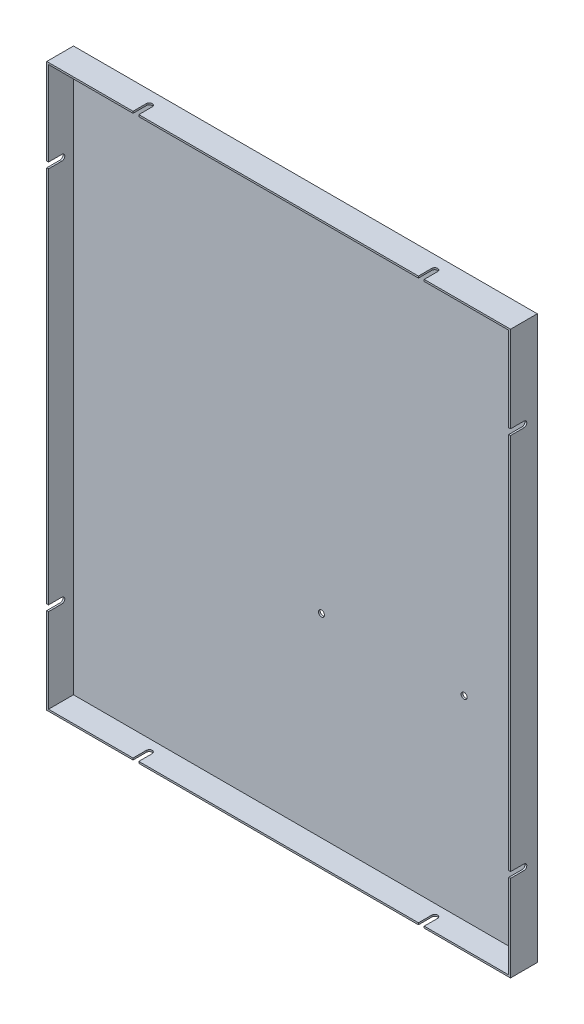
ISO-10303-21;
HEADER;
FILE_DESCRIPTION(('STEP AP214'),'2;1');
FILE_NAME('part.step','',(''),(''),'','','');
FILE_SCHEMA(('AUTOMOTIVE_DESIGN { 1 0 10303 214 1 1 1 1 }'));
ENDSEC;
DATA;
#1=APPLICATION_CONTEXT('core data for automotive mechanical design processes');
#2=APPLICATION_PROTOCOL_DEFINITION('international standard','automotive_design',2000,#1);
#3=PRODUCT_CONTEXT('',#1,'mechanical');
#4=PRODUCT('Part','Part','',(#3));
#5=PRODUCT_RELATED_PRODUCT_CATEGORY('part','',(#4));
#6=PRODUCT_DEFINITION_FORMATION('','',#4);
#7=PRODUCT_DEFINITION_CONTEXT('part definition',#1,'design');
#8=PRODUCT_DEFINITION('design','',#6,#7);
#9=PRODUCT_DEFINITION_SHAPE('','',#8);
#10=(LENGTH_UNIT() NAMED_UNIT(*) SI_UNIT(.MILLI.,.METRE.));
#11=(NAMED_UNIT(*) PLANE_ANGLE_UNIT() SI_UNIT($,.RADIAN.));
#12=(NAMED_UNIT(*) SI_UNIT($,.STERADIAN.) SOLID_ANGLE_UNIT());
#13=UNCERTAINTY_MEASURE_WITH_UNIT(LENGTH_MEASURE(1.E-05),#10,'distance_accuracy_value','');
#14=(GEOMETRIC_REPRESENTATION_CONTEXT(3) GLOBAL_UNCERTAINTY_ASSIGNED_CONTEXT((#13)) GLOBAL_UNIT_ASSIGNED_CONTEXT((#10,
#11,#12)) REPRESENTATION_CONTEXT('',''));
#15=CARTESIAN_POINT('',(0.,0.,0.));
#16=DIRECTION('',(0.,0.,1.));
#17=DIRECTION('',(1.,0.,0.));
#18=AXIS2_PLACEMENT_3D('',#15,#16,#17);
#19=CARTESIAN_POINT('',(0.,-630.,30.));
#20=DIRECTION('',(0.,0.,1.));
#21=DIRECTION('',(1.,0.,0.));
#22=AXIS2_PLACEMENT_3D('',#19,#20,#21);
#23=PLANE('',#22);
#24=DIRECTION('',(0.,1.,0.));
#25=VECTOR('',#24,1.);
#26=CARTESIAN_POINT('',(416.75,-630.,30.));
#27=LINE('',#26,#25);
#28=CARTESIAN_POINT('',(416.75,-630.,30.));
#29=VERTEX_POINT('',#28);
#30=CARTESIAN_POINT('',(416.75,-628.,30.));
#31=VERTEX_POINT('',#30);
#32=EDGE_CURVE('E416',#29,#31,#27,.T.);
#33=ORIENTED_EDGE('',*,*,#32,.T.);
#34=DIRECTION('',(1.,0.,0.));
#35=VECTOR('',#34,1.);
#36=CARTESIAN_POINT('',(0.,-628.,30.));
#37=LINE('',#36,#35);
#38=CARTESIAN_POINT('',(103.25,-628.,30.));
#39=VERTEX_POINT('',#38);
#40=EDGE_CURVE('E575',#39,#31,#37,.T.);
#41=ORIENTED_EDGE('',*,*,#40,.F.);
#42=DIRECTION('',(0.,1.,0.));
#43=VECTOR('',#42,1.);
#44=CARTESIAN_POINT('',(103.25,-630.,30.));
#45=LINE('',#44,#43);
#46=CARTESIAN_POINT('',(103.25,-630.,30.));
#47=VERTEX_POINT('',#46);
#48=EDGE_CURVE('E450',#47,#39,#45,.T.);
#49=ORIENTED_EDGE('',*,*,#48,.F.);
#50=DIRECTION('',(1.,0.,0.));
#51=VECTOR('',#50,1.);
#52=CARTESIAN_POINT('',(0.,-630.,30.));
#53=LINE('',#52,#51);
#54=EDGE_CURVE('E314',#47,#29,#53,.T.);
#55=ORIENTED_EDGE('',*,*,#54,.T.);
#56=EDGE_LOOP('',(#33,#41,#49,#55));
#57=FACE_BOUND('',#56,.T.);
#58=ADVANCED_FACE('F35',(#57),#23,.T.);
#59=CARTESIAN_POINT('',(416.75,-2.,30.));
#60=VERTEX_POINT('',#59);
#61=CARTESIAN_POINT('',(416.75,0.,30.));
#62=VERTEX_POINT('',#61);
#63=EDGE_CURVE('E1068',#60,#62,#27,.T.);
#64=ORIENTED_EDGE('',*,*,#63,.T.);
#65=DIRECTION('',(-1.,0.,0.));
#66=VECTOR('',#65,1.);
#67=CARTESIAN_POINT('',(0.,0.,30.));
#68=LINE('',#67,#66);
#69=CARTESIAN_POINT('',(103.25,0.,30.));
#70=VERTEX_POINT('',#69);
#71=EDGE_CURVE('E339',#62,#70,#68,.T.);
#72=ORIENTED_EDGE('',*,*,#71,.T.);
#73=CARTESIAN_POINT('',(103.25,-2.,30.));
#74=VERTEX_POINT('',#73);
#75=EDGE_CURVE('E431',#74,#70,#45,.T.);
#76=ORIENTED_EDGE('',*,*,#75,.F.);
#77=DIRECTION('',(-1.,0.,0.));
#78=VECTOR('',#77,1.);
#79=CARTESIAN_POINT('',(0.,-2.,30.));
#80=LINE('',#79,#78);
#81=EDGE_CURVE('E581',#60,#74,#80,.T.);
#82=ORIENTED_EDGE('',*,*,#81,.F.);
#83=EDGE_LOOP('',(#64,#72,#76,#82));
#84=FACE_BOUND('',#83,.T.);
#85=ADVANCED_FACE('F688',(#84),#23,.T.);
#86=DIRECTION('',(0.,1.,0.));
#87=VECTOR('',#86,1.);
#88=CARTESIAN_POINT('',(96.75,-630.,30.));
#89=LINE('',#88,#87);
#90=CARTESIAN_POINT('',(96.75,-630.,30.));
#91=VERTEX_POINT('',#90);
#92=CARTESIAN_POINT('',(96.75,-628.,30.));
#93=VERTEX_POINT('',#92);
#94=EDGE_CURVE('E438',#91,#93,#89,.T.);
#95=ORIENTED_EDGE('',*,*,#94,.T.);
#96=CARTESIAN_POINT('',(2.00000000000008,-628.,30.));
#97=VERTEX_POINT('',#96);
#98=EDGE_CURVE('E571',#97,#93,#37,.T.);
#99=ORIENTED_EDGE('',*,*,#98,.F.);
#100=DIRECTION('',(0.,-1.,0.));
#101=VECTOR('',#100,1.);
#102=CARTESIAN_POINT('',(2.,0.,30.));
#103=LINE('',#102,#101);
#104=CARTESIAN_POINT('',(2.00000000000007,-533.25,30.));
#105=VERTEX_POINT('',#104);
#106=EDGE_CURVE('E566',#105,#97,#103,.T.);
#107=ORIENTED_EDGE('',*,*,#106,.F.);
#108=DIRECTION('',(-1.,0.,0.));
#109=VECTOR('',#108,1.);
#110=CARTESIAN_POINT('',(520.,-533.25,30.));
#111=LINE('',#110,#109);
#112=CARTESIAN_POINT('',(0.,-533.25,30.));
#113=VERTEX_POINT('',#112);
#114=EDGE_CURVE('E485',#105,#113,#111,.T.);
#115=ORIENTED_EDGE('',*,*,#114,.T.);
#116=DIRECTION('',(0.,-1.,0.));
#117=VECTOR('',#116,1.);
#118=CARTESIAN_POINT('',(0.,0.,30.));
#119=LINE('',#118,#117);
#120=CARTESIAN_POINT('',(0.,-630.,30.));
#121=VERTEX_POINT('',#120);
#122=EDGE_CURVE('E322',#113,#121,#119,.T.);
#123=ORIENTED_EDGE('',*,*,#122,.T.);
#124=EDGE_CURVE('E317',#121,#91,#53,.T.);
#125=ORIENTED_EDGE('',*,*,#124,.T.);
#126=EDGE_LOOP('',(#95,#99,#107,#115,#123,#125));
#127=FACE_BOUND('',#126,.T.);
#128=ADVANCED_FACE('F625',(#127),#23,.T.);
#129=CARTESIAN_POINT('',(96.75,-2.,30.));
#130=VERTEX_POINT('',#129);
#131=CARTESIAN_POINT('',(96.75,0.,30.));
#132=VERTEX_POINT('',#131);
#133=EDGE_CURVE('E441',#130,#132,#89,.T.);
#134=ORIENTED_EDGE('',*,*,#133,.T.);
#135=CARTESIAN_POINT('',(0.,0.,30.));
#136=VERTEX_POINT('',#135);
#137=EDGE_CURVE('E337',#132,#136,#68,.T.);
#138=ORIENTED_EDGE('',*,*,#137,.T.);
#139=CARTESIAN_POINT('',(0.,-96.75,30.));
#140=VERTEX_POINT('',#139);
#141=EDGE_CURVE('E315',#136,#140,#119,.T.);
#142=ORIENTED_EDGE('',*,*,#141,.T.);
#143=DIRECTION('',(-1.,0.,0.));
#144=VECTOR('',#143,1.);
#145=CARTESIAN_POINT('',(520.,-96.7499999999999,30.));
#146=LINE('',#145,#144);
#147=CARTESIAN_POINT('',(2.,-96.75,30.));
#148=VERTEX_POINT('',#147);
#149=EDGE_CURVE('E504',#148,#140,#146,.T.);
#150=ORIENTED_EDGE('',*,*,#149,.F.);
#151=CARTESIAN_POINT('',(2.,-2.,30.));
#152=VERTEX_POINT('',#151);
#153=EDGE_CURVE('E567',#152,#148,#103,.T.);
#154=ORIENTED_EDGE('',*,*,#153,.F.);
#155=EDGE_CURVE('E579',#130,#152,#80,.T.);
#156=ORIENTED_EDGE('',*,*,#155,.F.);
#157=EDGE_LOOP('',(#134,#138,#142,#150,#154,#156));
#158=FACE_BOUND('',#157,.T.);
#159=ADVANCED_FACE('F594',(#158),#23,.T.);
#160=DIRECTION('',(-1.,0.,0.));
#161=VECTOR('',#160,1.);
#162=CARTESIAN_POINT('',(520.,-526.75,30.));
#163=LINE('',#162,#161);
#164=CARTESIAN_POINT('',(2.00000000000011,-526.75,30.));
#165=VERTEX_POINT('',#164);
#166=CARTESIAN_POINT('',(0.,-526.75,30.));
#167=VERTEX_POINT('',#166);
#168=EDGE_CURVE('E482',#165,#167,#163,.T.);
#169=ORIENTED_EDGE('',*,*,#168,.F.);
#170=CARTESIAN_POINT('',(2.,-103.25,30.));
#171=VERTEX_POINT('',#170);
#172=EDGE_CURVE('E570',#171,#165,#103,.T.);
#173=ORIENTED_EDGE('',*,*,#172,.F.);
#174=DIRECTION('',(-1.,0.,0.));
#175=VECTOR('',#174,1.);
#176=CARTESIAN_POINT('',(520.,-103.25,30.));
#177=LINE('',#176,#175);
#178=CARTESIAN_POINT('',(0.,-103.25,30.));
#179=VERTEX_POINT('',#178);
#180=EDGE_CURVE('E515',#171,#179,#177,.T.);
#181=ORIENTED_EDGE('',*,*,#180,.T.);
#182=EDGE_CURVE('E320',#179,#167,#119,.T.);
#183=ORIENTED_EDGE('',*,*,#182,.T.);
#184=EDGE_LOOP('',(#169,#173,#181,#183));
#185=FACE_BOUND('',#184,.T.);
#186=ADVANCED_FACE('F613',(#185),#23,.T.);
#187=CARTESIAN_POINT('',(520.,-526.75,30.));
#188=VERTEX_POINT('',#187);
#189=CARTESIAN_POINT('',(518.,-526.75,30.));
#190=VERTEX_POINT('',#189);
#191=EDGE_CURVE('E480',#188,#190,#163,.T.);
#192=ORIENTED_EDGE('',*,*,#191,.F.);
#193=DIRECTION('',(0.,1.,0.));
#194=VECTOR('',#193,1.);
#195=CARTESIAN_POINT('',(520.,0.,30.));
#196=LINE('',#195,#194);
#197=CARTESIAN_POINT('',(520.,-103.25,30.));
#198=VERTEX_POINT('',#197);
#199=EDGE_CURVE('E329',#188,#198,#196,.T.);
#200=ORIENTED_EDGE('',*,*,#199,.T.);
#201=CARTESIAN_POINT('',(518.,-103.25,30.));
#202=VERTEX_POINT('',#201);
#203=EDGE_CURVE('E511',#198,#202,#177,.T.);
#204=ORIENTED_EDGE('',*,*,#203,.T.);
#205=DIRECTION('',(0.,1.,0.));
#206=VECTOR('',#205,1.);
#207=CARTESIAN_POINT('',(518.,0.,30.));
#208=LINE('',#207,#206);
#209=EDGE_CURVE('E580',#190,#202,#208,.T.);
#210=ORIENTED_EDGE('',*,*,#209,.F.);
#211=EDGE_LOOP('',(#192,#200,#204,#210));
#212=FACE_BOUND('',#211,.T.);
#213=ADVANCED_FACE('F664',(#212),#23,.T.);
#214=DIRECTION('',(0.,1.,0.));
#215=VECTOR('',#214,1.);
#216=CARTESIAN_POINT('',(423.25,-630.,30.));
#217=LINE('',#216,#215);
#218=CARTESIAN_POINT('',(423.25,-630.,30.));
#219=VERTEX_POINT('',#218);
#220=CARTESIAN_POINT('',(423.25,-628.,30.));
#221=VERTEX_POINT('',#220);
#222=EDGE_CURVE('E50',#219,#221,#217,.T.);
#223=ORIENTED_EDGE('',*,*,#222,.F.);
#224=CARTESIAN_POINT('',(520.,-630.,30.));
#225=VERTEX_POINT('',#224);
#226=EDGE_CURVE('E304',#219,#225,#53,.T.);
#227=ORIENTED_EDGE('',*,*,#226,.T.);
#228=CARTESIAN_POINT('',(520.,-533.25,30.));
#229=VERTEX_POINT('',#228);
#230=EDGE_CURVE('E330',#225,#229,#196,.T.);
#231=ORIENTED_EDGE('',*,*,#230,.T.);
#232=CARTESIAN_POINT('',(518.,-533.25,30.));
#233=VERTEX_POINT('',#232);
#234=EDGE_CURVE('E483',#229,#233,#111,.T.);
#235=ORIENTED_EDGE('',*,*,#234,.T.);
#236=CARTESIAN_POINT('',(518.,-628.,30.));
#237=VERTEX_POINT('',#236);
#238=EDGE_CURVE('E576',#237,#233,#208,.T.);
#239=ORIENTED_EDGE('',*,*,#238,.F.);
#240=EDGE_CURVE('E307',#221,#237,#37,.T.);
#241=ORIENTED_EDGE('',*,*,#240,.F.);
#242=EDGE_LOOP('',(#223,#227,#231,#235,#239,#241));
#243=FACE_BOUND('',#242,.T.);
#244=ADVANCED_FACE('F302',(#243),#23,.T.);
#245=CARTESIAN_POINT('',(0.,0.,30.));
#246=DIRECTION('',(1.,0.,0.));
#247=DIRECTION('',(0.,1.,0.));
#248=AXIS2_PLACEMENT_3D('',#245,#246,#247);
#249=PLANE('',#248);
#250=CARTESIAN_POINT('',(0.,-530.,15.));
#251=DIRECTION('',(-1.,0.,0.));
#252=DIRECTION('',(0.,-1.,0.));
#253=AXIS2_PLACEMENT_3D('',#250,#251,#252);
#254=CIRCLE('',#253,3.24999999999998);
#255=CARTESIAN_POINT('',(0.,-526.75,15.));
#256=VERTEX_POINT('',#255);
#257=CARTESIAN_POINT('',(0.,-533.25,15.));
#258=VERTEX_POINT('',#257);
#259=EDGE_CURVE('E457',#256,#258,#254,.T.);
#260=ORIENTED_EDGE('',*,*,#259,.F.);
#261=DIRECTION('',(0.,0.,-1.));
#262=VECTOR('',#261,1.);
#263=CARTESIAN_POINT('',(0.,-526.75,15.));
#264=LINE('',#263,#262);
#265=EDGE_CURVE('E462',#167,#256,#264,.T.);
#266=ORIENTED_EDGE('',*,*,#265,.F.);
#267=ORIENTED_EDGE('',*,*,#182,.F.);
#268=DIRECTION('',(0.,0.,1.));
#269=VECTOR('',#268,1.);
#270=CARTESIAN_POINT('',(0.,-103.25,30.));
#271=LINE('',#270,#269);
#272=CARTESIAN_POINT('',(0.,-103.25,15.));
#273=VERTEX_POINT('',#272);
#274=EDGE_CURVE('E498',#273,#179,#271,.T.);
#275=ORIENTED_EDGE('',*,*,#274,.F.);
#276=CARTESIAN_POINT('',(0.,-100.,15.));
#277=DIRECTION('',(-1.,0.,0.));
#278=DIRECTION('',(0.,-1.,0.));
#279=AXIS2_PLACEMENT_3D('',#276,#277,#278);
#280=CIRCLE('',#279,3.24999999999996);
#281=CARTESIAN_POINT('',(0.,-96.75,15.));
#282=VERTEX_POINT('',#281);
#283=EDGE_CURVE('E507',#282,#273,#280,.T.);
#284=ORIENTED_EDGE('',*,*,#283,.F.);
#285=DIRECTION('',(0.,0.,-1.));
#286=VECTOR('',#285,1.);
#287=CARTESIAN_POINT('',(0.,-96.75,30.));
#288=LINE('',#287,#286);
#289=EDGE_CURVE('E493',#140,#282,#288,.T.);
#290=ORIENTED_EDGE('',*,*,#289,.F.);
#291=ORIENTED_EDGE('',*,*,#141,.F.);
#292=DIRECTION('',(0.,0.,-1.));
#293=VECTOR('',#292,1.);
#294=CARTESIAN_POINT('',(0.,0.,30.));
#295=LINE('',#294,#293);
#296=CARTESIAN_POINT('',(0.,0.,0.));
#297=VERTEX_POINT('',#296);
#298=EDGE_CURVE('E346',#136,#297,#295,.T.);
#299=ORIENTED_EDGE('',*,*,#298,.T.);
#300=DIRECTION('',(0.,-1.,0.));
#301=VECTOR('',#300,1.);
#302=CARTESIAN_POINT('',(0.,0.,0.));
#303=LINE('',#302,#301);
#304=CARTESIAN_POINT('',(0.,-630.,0.));
#305=VERTEX_POINT('',#304);
#306=EDGE_CURVE('E551',#297,#305,#303,.T.);
#307=ORIENTED_EDGE('',*,*,#306,.T.);
#308=DIRECTION('',(0.,0.,-1.));
#309=VECTOR('',#308,1.);
#310=CARTESIAN_POINT('',(0.,-630.,30.));
#311=LINE('',#310,#309);
#312=EDGE_CURVE('E363',#121,#305,#311,.T.);
#313=ORIENTED_EDGE('',*,*,#312,.F.);
#314=ORIENTED_EDGE('',*,*,#122,.F.);
#315=DIRECTION('',(0.,0.,1.));
#316=VECTOR('',#315,1.);
#317=CARTESIAN_POINT('',(0.,-533.25,15.));
#318=LINE('',#317,#316);
#319=EDGE_CURVE('E471',#258,#113,#318,.T.);
#320=ORIENTED_EDGE('',*,*,#319,.F.);
#321=EDGE_LOOP('',(#260,#266,#267,#275,#284,#290,#291,#299,#307,#313,#314,#320));
#322=FACE_BOUND('',#321,.T.);
#323=ADVANCED_FACE('F37',(#322),#249,.F.);
#324=CARTESIAN_POINT('',(0.,-630.,30.));
#325=DIRECTION('',(0.,1.,0.));
#326=DIRECTION('',(0.,0.,1.));
#327=AXIS2_PLACEMENT_3D('',#324,#325,#326);
#328=PLANE('',#327);
#329=CARTESIAN_POINT('',(420.,-630.,15.));
#330=DIRECTION('',(0.,1.,0.));
#331=DIRECTION('',(0.,0.,1.));
#332=AXIS2_PLACEMENT_3D('',#329,#330,#331);
#333=CIRCLE('',#332,3.24999999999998);
#334=CARTESIAN_POINT('',(423.25,-630.,15.));
#335=VERTEX_POINT('',#334);
#336=CARTESIAN_POINT('',(416.75,-630.,15.));
#337=VERTEX_POINT('',#336);
#338=EDGE_CURVE('E297',#335,#337,#333,.T.);
#339=ORIENTED_EDGE('',*,*,#338,.T.);
#340=DIRECTION('',(0.,0.,1.));
#341=VECTOR('',#340,1.);
#342=CARTESIAN_POINT('',(416.75,-630.,30.));
#343=LINE('',#342,#341);
#344=EDGE_CURVE('E407',#337,#29,#343,.T.);
#345=ORIENTED_EDGE('',*,*,#344,.T.);
#346=ORIENTED_EDGE('',*,*,#54,.F.);
#347=DIRECTION('',(0.,0.,-1.));
#348=VECTOR('',#347,1.);
#349=CARTESIAN_POINT('',(103.25,-630.,30.));
#350=LINE('',#349,#348);
#351=CARTESIAN_POINT('',(103.25,-630.,15.));
#352=VERTEX_POINT('',#351);
#353=EDGE_CURVE('E421',#47,#352,#350,.T.);
#354=ORIENTED_EDGE('',*,*,#353,.T.);
#355=CARTESIAN_POINT('',(100.,-630.,15.));
#356=DIRECTION('',(0.,1.,0.));
#357=DIRECTION('',(0.,0.,1.));
#358=AXIS2_PLACEMENT_3D('',#355,#356,#357);
#359=CIRCLE('',#358,3.25000000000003);
#360=CARTESIAN_POINT('',(96.75,-630.,15.));
#361=VERTEX_POINT('',#360);
#362=EDGE_CURVE('E424',#352,#361,#359,.T.);
#363=ORIENTED_EDGE('',*,*,#362,.T.);
#364=DIRECTION('',(0.,0.,1.));
#365=VECTOR('',#364,1.);
#366=CARTESIAN_POINT('',(96.75,-630.,30.));
#367=LINE('',#366,#365);
#368=EDGE_CURVE('E428',#361,#91,#367,.T.);
#369=ORIENTED_EDGE('',*,*,#368,.T.);
#370=ORIENTED_EDGE('',*,*,#124,.F.);
#371=ORIENTED_EDGE('',*,*,#312,.T.);
#372=DIRECTION('',(1.,0.,0.));
#373=VECTOR('',#372,1.);
#374=CARTESIAN_POINT('',(0.,-630.,0.));
#375=LINE('',#374,#373);
#376=CARTESIAN_POINT('',(520.,-630.,0.));
#377=VERTEX_POINT('',#376);
#378=EDGE_CURVE('E1048',#305,#377,#375,.T.);
#379=ORIENTED_EDGE('',*,*,#378,.T.);
#380=DIRECTION('',(0.,0.,-1.));
#381=VECTOR('',#380,1.);
#382=CARTESIAN_POINT('',(520.,-630.,30.));
#383=LINE('',#382,#381);
#384=EDGE_CURVE('E312',#225,#377,#383,.T.);
#385=ORIENTED_EDGE('',*,*,#384,.F.);
#386=ORIENTED_EDGE('',*,*,#226,.F.);
#387=DIRECTION('',(0.,0.,-1.));
#388=VECTOR('',#387,1.);
#389=CARTESIAN_POINT('',(423.25,-630.,30.));
#390=LINE('',#389,#388);
#391=EDGE_CURVE('E289',#219,#335,#390,.T.);
#392=ORIENTED_EDGE('',*,*,#391,.T.);
#393=EDGE_LOOP('',(#339,#345,#346,#354,#363,#369,#370,#371,#379,#385,#386,#392));
#394=FACE_BOUND('',#393,.T.);
#395=ADVANCED_FACE('F310',(#394),#328,.F.);
#396=CARTESIAN_POINT('',(520.,0.,30.));
#397=DIRECTION('',(-1.,0.,0.));
#398=DIRECTION('',(0.,-1.,0.));
#399=AXIS2_PLACEMENT_3D('',#396,#397,#398);
#400=PLANE('',#399);
#401=ORIENTED_EDGE('',*,*,#199,.F.);
#402=DIRECTION('',(0.,0.,-1.));
#403=VECTOR('',#402,1.);
#404=CARTESIAN_POINT('',(520.,-526.75,15.));
#405=LINE('',#404,#403);
#406=CARTESIAN_POINT('',(520.,-526.75,15.));
#407=VERTEX_POINT('',#406);
#408=EDGE_CURVE('E465',#188,#407,#405,.T.);
#409=ORIENTED_EDGE('',*,*,#408,.T.);
#410=CARTESIAN_POINT('',(520.,-530.,15.));
#411=DIRECTION('',(-1.,0.,0.));
#412=DIRECTION('',(0.,-1.,0.));
#413=AXIS2_PLACEMENT_3D('',#410,#411,#412);
#414=CIRCLE('',#413,3.24999999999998);
#415=CARTESIAN_POINT('',(520.,-533.25,15.));
#416=VERTEX_POINT('',#415);
#417=EDGE_CURVE('E458',#407,#416,#414,.T.);
#418=ORIENTED_EDGE('',*,*,#417,.T.);
#419=DIRECTION('',(0.,0.,1.));
#420=VECTOR('',#419,1.);
#421=CARTESIAN_POINT('',(520.,-533.25,15.));
#422=LINE('',#421,#420);
#423=EDGE_CURVE('E461',#416,#229,#422,.T.);
#424=ORIENTED_EDGE('',*,*,#423,.T.);
#425=ORIENTED_EDGE('',*,*,#230,.F.);
#426=ORIENTED_EDGE('',*,*,#384,.T.);
#427=DIRECTION('',(0.,1.,0.));
#428=VECTOR('',#427,1.);
#429=CARTESIAN_POINT('',(520.,0.,0.));
#430=LINE('',#429,#428);
#431=CARTESIAN_POINT('',(520.,0.,0.));
#432=VERTEX_POINT('',#431);
#433=EDGE_CURVE('E1049',#377,#432,#430,.T.);
#434=ORIENTED_EDGE('',*,*,#433,.T.);
#435=DIRECTION('',(0.,0.,-1.));
#436=VECTOR('',#435,1.);
#437=CARTESIAN_POINT('',(520.,0.,30.));
#438=LINE('',#437,#436);
#439=CARTESIAN_POINT('',(520.,0.,30.));
#440=VERTEX_POINT('',#439);
#441=EDGE_CURVE('E350',#440,#432,#438,.T.);
#442=ORIENTED_EDGE('',*,*,#441,.F.);
#443=CARTESIAN_POINT('',(520.,-96.7499999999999,30.));
#444=VERTEX_POINT('',#443);
#445=EDGE_CURVE('E325',#444,#440,#196,.T.);
#446=ORIENTED_EDGE('',*,*,#445,.F.);
#447=DIRECTION('',(0.,0.,-1.));
#448=VECTOR('',#447,1.);
#449=CARTESIAN_POINT('',(520.,-96.7499999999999,30.));
#450=LINE('',#449,#448);
#451=CARTESIAN_POINT('',(520.,-96.75,15.));
#452=VERTEX_POINT('',#451);
#453=EDGE_CURVE('E494',#444,#452,#450,.T.);
#454=ORIENTED_EDGE('',*,*,#453,.T.);
#455=CARTESIAN_POINT('',(520.,-99.9999999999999,15.));
#456=DIRECTION('',(-1.,0.,0.));
#457=DIRECTION('',(0.,-1.,0.));
#458=AXIS2_PLACEMENT_3D('',#455,#456,#457);
#459=CIRCLE('',#458,3.24999999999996);
#460=CARTESIAN_POINT('',(520.,-103.25,15.));
#461=VERTEX_POINT('',#460);
#462=EDGE_CURVE('E497',#452,#461,#459,.T.);
#463=ORIENTED_EDGE('',*,*,#462,.T.);
#464=DIRECTION('',(0.,0.,1.));
#465=VECTOR('',#464,1.);
#466=CARTESIAN_POINT('',(520.,-103.25,30.));
#467=LINE('',#466,#465);
#468=EDGE_CURVE('E501',#461,#198,#467,.T.);
#469=ORIENTED_EDGE('',*,*,#468,.T.);
#470=EDGE_LOOP('',(#401,#409,#418,#424,#425,#426,#434,#442,#446,#454,#463,#469));
#471=FACE_BOUND('',#470,.T.);
#472=ADVANCED_FACE('F654',(#471),#400,.F.);
#473=CARTESIAN_POINT('',(0.,0.,30.));
#474=DIRECTION('',(0.,-1.,0.));
#475=DIRECTION('',(0.,0.,-1.));
#476=AXIS2_PLACEMENT_3D('',#473,#474,#475);
#477=PLANE('',#476);
#478=ORIENTED_EDGE('',*,*,#71,.F.);
#479=DIRECTION('',(0.,0.,1.));
#480=VECTOR('',#479,1.);
#481=CARTESIAN_POINT('',(416.75,0.,30.));
#482=LINE('',#481,#480);
#483=CARTESIAN_POINT('',(416.75,0.,15.));
#484=VERTEX_POINT('',#483);
#485=EDGE_CURVE('E298',#484,#62,#482,.T.);
#486=ORIENTED_EDGE('',*,*,#485,.F.);
#487=CARTESIAN_POINT('',(420.,0.,15.));
#488=DIRECTION('',(0.,1.,0.));
#489=DIRECTION('',(0.,0.,1.));
#490=AXIS2_PLACEMENT_3D('',#487,#488,#489);
#491=CIRCLE('',#490,3.24999999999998);
#492=CARTESIAN_POINT('',(423.25,0.,15.));
#493=VERTEX_POINT('',#492);
#494=EDGE_CURVE('E1062',#493,#484,#491,.T.);
#495=ORIENTED_EDGE('',*,*,#494,.F.);
#496=DIRECTION('',(0.,0.,-1.));
#497=VECTOR('',#496,1.);
#498=CARTESIAN_POINT('',(423.25,0.,30.));
#499=LINE('',#498,#497);
#500=CARTESIAN_POINT('',(423.25,0.,30.));
#501=VERTEX_POINT('',#500);
#502=EDGE_CURVE('E1060',#501,#493,#499,.T.);
#503=ORIENTED_EDGE('',*,*,#502,.F.);
#504=EDGE_CURVE('E340',#440,#501,#68,.T.);
#505=ORIENTED_EDGE('',*,*,#504,.F.);
#506=ORIENTED_EDGE('',*,*,#441,.T.);
#507=DIRECTION('',(-1.,0.,0.));
#508=VECTOR('',#507,1.);
#509=CARTESIAN_POINT('',(0.,0.,0.));
#510=LINE('',#509,#508);
#511=EDGE_CURVE('E359',#432,#297,#510,.T.);
#512=ORIENTED_EDGE('',*,*,#511,.T.);
#513=ORIENTED_EDGE('',*,*,#298,.F.);
#514=ORIENTED_EDGE('',*,*,#137,.F.);
#515=DIRECTION('',(0.,0.,1.));
#516=VECTOR('',#515,1.);
#517=CARTESIAN_POINT('',(96.75,0.,30.));
#518=LINE('',#517,#516);
#519=CARTESIAN_POINT('',(96.75,0.,15.));
#520=VERTEX_POINT('',#519);
#521=EDGE_CURVE('E425',#520,#132,#518,.T.);
#522=ORIENTED_EDGE('',*,*,#521,.F.);
#523=CARTESIAN_POINT('',(100.,0.,15.));
#524=DIRECTION('',(0.,1.,0.));
#525=DIRECTION('',(0.,0.,1.));
#526=AXIS2_PLACEMENT_3D('',#523,#524,#525);
#527=CIRCLE('',#526,3.25000000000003);
#528=CARTESIAN_POINT('',(103.25,0.,15.));
#529=VERTEX_POINT('',#528);
#530=EDGE_CURVE('E434',#529,#520,#527,.T.);
#531=ORIENTED_EDGE('',*,*,#530,.F.);
#532=DIRECTION('',(0.,0.,-1.));
#533=VECTOR('',#532,1.);
#534=CARTESIAN_POINT('',(103.25,0.,30.));
#535=LINE('',#534,#533);
#536=EDGE_CURVE('E420',#70,#529,#535,.T.);
#537=ORIENTED_EDGE('',*,*,#536,.F.);
#538=EDGE_LOOP('',(#478,#486,#495,#503,#505,#506,#512,#513,#514,#522,#531,#537));
#539=FACE_BOUND('',#538,.T.);
#540=ADVANCED_FACE('F697',(#539),#477,.F.);
#541=CARTESIAN_POINT('',(423.25,-2.,30.));
#542=VERTEX_POINT('',#541);
#543=EDGE_CURVE('E308',#542,#501,#217,.T.);
#544=ORIENTED_EDGE('',*,*,#543,.F.);
#545=CARTESIAN_POINT('',(518.,-2.,30.));
#546=VERTEX_POINT('',#545);
#547=EDGE_CURVE('E402',#546,#542,#80,.T.);
#548=ORIENTED_EDGE('',*,*,#547,.F.);
#549=CARTESIAN_POINT('',(518.,-96.7499999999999,30.));
#550=VERTEX_POINT('',#549);
#551=EDGE_CURVE('E574',#550,#546,#208,.T.);
#552=ORIENTED_EDGE('',*,*,#551,.F.);
#553=EDGE_CURVE('E524',#444,#550,#146,.T.);
#554=ORIENTED_EDGE('',*,*,#553,.F.);
#555=ORIENTED_EDGE('',*,*,#445,.T.);
#556=ORIENTED_EDGE('',*,*,#504,.T.);
#557=EDGE_LOOP('',(#544,#548,#552,#554,#555,#556));
#558=FACE_BOUND('',#557,.T.);
#559=ADVANCED_FACE('F405',(#558),#23,.T.);
#560=CARTESIAN_POINT('',(0.,-630.,0.));
#561=DIRECTION('',(0.,0.,1.));
#562=DIRECTION('',(1.,0.,0.));
#563=AXIS2_PLACEMENT_3D('',#560,#561,#562);
#564=PLANE('',#563);
#565=CARTESIAN_POINT('',(280.,-410.,0.));
#566=DIRECTION('',(0.,0.,1.));
#567=DIRECTION('',(1.,0.,0.));
#568=AXIS2_PLACEMENT_3D('',#565,#566,#567);
#569=CIRCLE('',#568,3.40000000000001);
#570=CARTESIAN_POINT('',(283.4,-410.,0.));
#571=VERTEX_POINT('',#570);
#572=EDGE_CURVE('E535',#571,#571,#569,.T.);
#573=ORIENTED_EDGE('',*,*,#572,.T.);
#574=EDGE_LOOP('',(#573));
#575=FACE_BOUND('',#574,.T.);
#576=CARTESIAN_POINT('',(440.,-410.,0.));
#577=DIRECTION('',(0.,0.,1.));
#578=DIRECTION('',(1.,0.,0.));
#579=AXIS2_PLACEMENT_3D('',#576,#577,#578);
#580=CIRCLE('',#579,3.40000000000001);
#581=CARTESIAN_POINT('',(443.4,-410.,0.));
#582=VERTEX_POINT('',#581);
#583=EDGE_CURVE('E541',#582,#582,#580,.T.);
#584=ORIENTED_EDGE('',*,*,#583,.T.);
#585=EDGE_LOOP('',(#584));
#586=FACE_BOUND('',#585,.T.);
#587=ORIENTED_EDGE('',*,*,#306,.F.);
#588=ORIENTED_EDGE('',*,*,#511,.F.);
#589=ORIENTED_EDGE('',*,*,#433,.F.);
#590=ORIENTED_EDGE('',*,*,#378,.F.);
#591=EDGE_LOOP('',(#587,#588,#589,#590));
#592=FACE_BOUND('',#591,.T.);
#593=ADVANCED_FACE('F696',(#575,#586,#592),#564,.F.);
#594=CARTESIAN_POINT('',(2.,0.,30.));
#595=DIRECTION('',(1.,0.,0.));
#596=DIRECTION('',(0.,1.,0.));
#597=AXIS2_PLACEMENT_3D('',#594,#595,#596);
#598=PLANE('',#597);
#599=DIRECTION('',(0.,0.,1.));
#600=VECTOR('',#599,1.);
#601=CARTESIAN_POINT('',(2.00000000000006,-526.75,30.));
#602=LINE('',#601,#600);
#603=CARTESIAN_POINT('',(2.00000000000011,-526.75,15.));
#604=VERTEX_POINT('',#603);
#605=EDGE_CURVE('E489',#604,#165,#602,.T.);
#606=ORIENTED_EDGE('',*,*,#605,.F.);
#607=CARTESIAN_POINT('',(2.00000000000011,-530.,15.));
#608=DIRECTION('',(1.,0.,0.));
#609=DIRECTION('',(0.,1.,0.));
#610=AXIS2_PLACEMENT_3D('',#607,#608,#609);
#611=CIRCLE('',#610,3.24999999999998);
#612=CARTESIAN_POINT('',(2.00000000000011,-533.25,15.));
#613=VERTEX_POINT('',#612);
#614=EDGE_CURVE('E491',#613,#604,#611,.T.);
#615=ORIENTED_EDGE('',*,*,#614,.F.);
#616=DIRECTION('',(0.,0.,-1.));
#617=VECTOR('',#616,1.);
#618=CARTESIAN_POINT('',(2.00000000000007,-533.25,30.));
#619=LINE('',#618,#617);
#620=EDGE_CURVE('E478',#105,#613,#619,.T.);
#621=ORIENTED_EDGE('',*,*,#620,.F.);
#622=ORIENTED_EDGE('',*,*,#106,.T.);
#623=DIRECTION('',(0.,0.,-1.));
#624=VECTOR('',#623,1.);
#625=CARTESIAN_POINT('',(2.00000000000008,-628.,30.));
#626=LINE('',#625,#624);
#627=CARTESIAN_POINT('',(2.00000000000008,-628.,2.));
#628=VERTEX_POINT('',#627);
#629=EDGE_CURVE('E548',#97,#628,#626,.T.);
#630=ORIENTED_EDGE('',*,*,#629,.T.);
#631=DIRECTION('',(0.,-1.,0.));
#632=VECTOR('',#631,1.);
#633=CARTESIAN_POINT('',(2.,0.,2.));
#634=LINE('',#633,#632);
#635=CARTESIAN_POINT('',(2.,-2.,2.));
#636=VERTEX_POINT('',#635);
#637=EDGE_CURVE('E544',#636,#628,#634,.T.);
#638=ORIENTED_EDGE('',*,*,#637,.F.);
#639=DIRECTION('',(0.,0.,-1.));
#640=VECTOR('',#639,1.);
#641=CARTESIAN_POINT('',(2.,-2.,30.));
#642=LINE('',#641,#640);
#643=EDGE_CURVE('E553',#152,#636,#642,.T.);
#644=ORIENTED_EDGE('',*,*,#643,.F.);
#645=ORIENTED_EDGE('',*,*,#153,.T.);
#646=DIRECTION('',(0.,0.,1.));
#647=VECTOR('',#646,1.);
#648=CARTESIAN_POINT('',(2.00000000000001,-96.75,30.0000000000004));
#649=LINE('',#648,#647);
#650=CARTESIAN_POINT('',(2.00000000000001,-96.75,15.));
#651=VERTEX_POINT('',#650);
#652=EDGE_CURVE('E514',#651,#148,#649,.T.);
#653=ORIENTED_EDGE('',*,*,#652,.F.);
#654=CARTESIAN_POINT('',(2.,-100.,15.));
#655=DIRECTION('',(1.,0.,0.));
#656=DIRECTION('',(0.,1.,0.));
#657=AXIS2_PLACEMENT_3D('',#654,#655,#656);
#658=CIRCLE('',#657,3.24999999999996);
#659=CARTESIAN_POINT('',(2.,-103.25,15.));
#660=VERTEX_POINT('',#659);
#661=EDGE_CURVE('E527',#660,#651,#658,.T.);
#662=ORIENTED_EDGE('',*,*,#661,.F.);
#663=DIRECTION('',(0.,0.,-1.));
#664=VECTOR('',#663,1.);
#665=CARTESIAN_POINT('',(2.00000000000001,-103.25,29.9999999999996));
#666=LINE('',#665,#664);
#667=EDGE_CURVE('E530',#171,#660,#666,.T.);
#668=ORIENTED_EDGE('',*,*,#667,.F.);
#669=ORIENTED_EDGE('',*,*,#172,.T.);
#670=EDGE_LOOP('',(#606,#615,#621,#622,#630,#638,#644,#645,#653,#662,#668,#669));
#671=FACE_BOUND('',#670,.T.);
#672=ADVANCED_FACE('F591',(#671),#598,.T.);
#673=CARTESIAN_POINT('',(0.,-628.,30.));
#674=DIRECTION('',(0.,1.,0.));
#675=DIRECTION('',(0.,0.,1.));
#676=AXIS2_PLACEMENT_3D('',#673,#674,#675);
#677=PLANE('',#676);
#678=DIRECTION('',(0.,0.,1.));
#679=VECTOR('',#678,1.);
#680=CARTESIAN_POINT('',(416.75,-628.,30.));
#681=LINE('',#680,#679);
#682=CARTESIAN_POINT('',(416.75,-628.,15.));
#683=VERTEX_POINT('',#682);
#684=EDGE_CURVE('E418',#683,#31,#681,.T.);
#685=ORIENTED_EDGE('',*,*,#684,.F.);
#686=CARTESIAN_POINT('',(420.,-628.,15.));
#687=DIRECTION('',(0.,1.,0.));
#688=DIRECTION('',(0.,0.,1.));
#689=AXIS2_PLACEMENT_3D('',#686,#687,#688);
#690=CIRCLE('',#689,3.24999999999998);
#691=CARTESIAN_POINT('',(423.25,-628.,15.));
#692=VERTEX_POINT('',#691);
#693=EDGE_CURVE('E415',#692,#683,#690,.T.);
#694=ORIENTED_EDGE('',*,*,#693,.F.);
#695=DIRECTION('',(0.,0.,-1.));
#696=VECTOR('',#695,1.);
#697=CARTESIAN_POINT('',(423.25,-628.,30.));
#698=LINE('',#697,#696);
#699=EDGE_CURVE('E413',#221,#692,#698,.T.);
#700=ORIENTED_EDGE('',*,*,#699,.F.);
#701=ORIENTED_EDGE('',*,*,#240,.T.);
#702=DIRECTION('',(0.,0.,-1.));
#703=VECTOR('',#702,1.);
#704=CARTESIAN_POINT('',(518.,-628.,30.));
#705=LINE('',#704,#703);
#706=CARTESIAN_POINT('',(518.,-628.,2.));
#707=VERTEX_POINT('',#706);
#708=EDGE_CURVE('E552',#237,#707,#705,.T.);
#709=ORIENTED_EDGE('',*,*,#708,.T.);
#710=DIRECTION('',(1.,0.,0.));
#711=VECTOR('',#710,1.);
#712=CARTESIAN_POINT('',(0.,-628.,2.));
#713=LINE('',#712,#711);
#714=EDGE_CURVE('E547',#628,#707,#713,.T.);
#715=ORIENTED_EDGE('',*,*,#714,.F.);
#716=ORIENTED_EDGE('',*,*,#629,.F.);
#717=ORIENTED_EDGE('',*,*,#98,.T.);
#718=DIRECTION('',(0.,0.,1.));
#719=VECTOR('',#718,1.);
#720=CARTESIAN_POINT('',(96.75,-628.,30.));
#721=LINE('',#720,#719);
#722=CARTESIAN_POINT('',(96.75,-628.,15.));
#723=VERTEX_POINT('',#722);
#724=EDGE_CURVE('E455',#723,#93,#721,.T.);
#725=ORIENTED_EDGE('',*,*,#724,.F.);
#726=CARTESIAN_POINT('',(100.,-628.,15.));
#727=DIRECTION('',(0.,1.,0.));
#728=DIRECTION('',(0.,0.,1.));
#729=AXIS2_PLACEMENT_3D('',#726,#727,#728);
#730=CIRCLE('',#729,3.25000000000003);
#731=CARTESIAN_POINT('',(103.25,-628.,15.));
#732=VERTEX_POINT('',#731);
#733=EDGE_CURVE('E453',#732,#723,#730,.T.);
#734=ORIENTED_EDGE('',*,*,#733,.F.);
#735=DIRECTION('',(0.,0.,-1.));
#736=VECTOR('',#735,1.);
#737=CARTESIAN_POINT('',(103.25,-628.,30.));
#738=LINE('',#737,#736);
#739=EDGE_CURVE('E440',#39,#732,#738,.T.);
#740=ORIENTED_EDGE('',*,*,#739,.F.);
#741=ORIENTED_EDGE('',*,*,#40,.T.);
#742=EDGE_LOOP('',(#685,#694,#700,#701,#709,#715,#716,#717,#725,#734,#740,#741));
#743=FACE_BOUND('',#742,.T.);
#744=ADVANCED_FACE('F623',(#743),#677,.T.);
#745=CARTESIAN_POINT('',(518.,0.,30.));
#746=DIRECTION('',(-1.,0.,0.));
#747=DIRECTION('',(0.,-1.,0.));
#748=AXIS2_PLACEMENT_3D('',#745,#746,#747);
#749=PLANE('',#748);
#750=DIRECTION('',(0.,0.,-1.));
#751=VECTOR('',#750,1.);
#752=CARTESIAN_POINT('',(518.,-526.75,30.));
#753=LINE('',#752,#751);
#754=CARTESIAN_POINT('',(518.,-526.75,15.));
#755=VERTEX_POINT('',#754);
#756=EDGE_CURVE('E378',#190,#755,#753,.T.);
#757=ORIENTED_EDGE('',*,*,#756,.F.);
#758=ORIENTED_EDGE('',*,*,#209,.T.);
#759=DIRECTION('',(0.,0.,1.));
#760=VECTOR('',#759,1.);
#761=CARTESIAN_POINT('',(518.,-103.25,29.9999999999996));
#762=LINE('',#761,#760);
#763=CARTESIAN_POINT('',(518.,-103.25,15.));
#764=VERTEX_POINT('',#763);
#765=EDGE_CURVE('E370',#764,#202,#762,.T.);
#766=ORIENTED_EDGE('',*,*,#765,.F.);
#767=CARTESIAN_POINT('',(518.,-99.9999999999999,15.));
#768=DIRECTION('',(-1.,0.,0.));
#769=DIRECTION('',(0.,-1.,0.));
#770=AXIS2_PLACEMENT_3D('',#767,#768,#769);
#771=CIRCLE('',#770,3.24999999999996);
#772=CARTESIAN_POINT('',(518.,-96.75,15.));
#773=VERTEX_POINT('',#772);
#774=EDGE_CURVE('E368',#773,#764,#771,.T.);
#775=ORIENTED_EDGE('',*,*,#774,.F.);
#776=DIRECTION('',(0.,0.,-1.));
#777=VECTOR('',#776,1.);
#778=CARTESIAN_POINT('',(518.,-96.7499999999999,30.0000000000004));
#779=LINE('',#778,#777);
#780=EDGE_CURVE('E366',#550,#773,#779,.T.);
#781=ORIENTED_EDGE('',*,*,#780,.F.);
#782=ORIENTED_EDGE('',*,*,#551,.T.);
#783=DIRECTION('',(0.,0.,-1.));
#784=VECTOR('',#783,1.);
#785=CARTESIAN_POINT('',(518.,-2.,30.));
#786=LINE('',#785,#784);
#787=CARTESIAN_POINT('',(518.,-2.,2.));
#788=VERTEX_POINT('',#787);
#789=EDGE_CURVE('E556',#546,#788,#786,.T.);
#790=ORIENTED_EDGE('',*,*,#789,.T.);
#791=DIRECTION('',(0.,1.,0.));
#792=VECTOR('',#791,1.);
#793=CARTESIAN_POINT('',(518.,0.,2.));
#794=LINE('',#793,#792);
#795=EDGE_CURVE('E558',#707,#788,#794,.T.);
#796=ORIENTED_EDGE('',*,*,#795,.F.);
#797=ORIENTED_EDGE('',*,*,#708,.F.);
#798=ORIENTED_EDGE('',*,*,#238,.T.);
#799=DIRECTION('',(0.,0.,1.));
#800=VECTOR('',#799,1.);
#801=CARTESIAN_POINT('',(518.,-533.25,30.));
#802=LINE('',#801,#800);
#803=CARTESIAN_POINT('',(518.,-533.25,15.));
#804=VERTEX_POINT('',#803);
#805=EDGE_CURVE('E373',#804,#233,#802,.T.);
#806=ORIENTED_EDGE('',*,*,#805,.F.);
#807=CARTESIAN_POINT('',(518.,-530.,15.));
#808=DIRECTION('',(-1.,0.,0.));
#809=DIRECTION('',(0.,-1.,0.));
#810=AXIS2_PLACEMENT_3D('',#807,#808,#809);
#811=CIRCLE('',#810,3.24999999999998);
#812=EDGE_CURVE('E375',#755,#804,#811,.T.);
#813=ORIENTED_EDGE('',*,*,#812,.F.);
#814=EDGE_LOOP('',(#757,#758,#766,#775,#781,#782,#790,#796,#797,#798,#806,#813));
#815=FACE_BOUND('',#814,.T.);
#816=ADVANCED_FACE('F647',(#815),#749,.T.);
#817=CARTESIAN_POINT('',(0.,-2.,30.));
#818=DIRECTION('',(0.,-1.,0.));
#819=DIRECTION('',(0.,0.,-1.));
#820=AXIS2_PLACEMENT_3D('',#817,#818,#819);
#821=PLANE('',#820);
#822=DIRECTION('',(0.,0.,-1.));
#823=VECTOR('',#822,1.);
#824=CARTESIAN_POINT('',(416.75,-2.,30.));
#825=LINE('',#824,#823);
#826=CARTESIAN_POINT('',(416.75,-2.,15.));
#827=VERTEX_POINT('',#826);
#828=EDGE_CURVE('E11',#60,#827,#825,.T.);
#829=ORIENTED_EDGE('',*,*,#828,.F.);
#830=ORIENTED_EDGE('',*,*,#81,.T.);
#831=DIRECTION('',(0.,0.,1.));
#832=VECTOR('',#831,1.);
#833=CARTESIAN_POINT('',(103.25,-2.,30.));
#834=LINE('',#833,#832);
#835=CARTESIAN_POINT('',(103.25,-2.,15.));
#836=VERTEX_POINT('',#835);
#837=EDGE_CURVE('E380',#836,#74,#834,.T.);
#838=ORIENTED_EDGE('',*,*,#837,.F.);
#839=CARTESIAN_POINT('',(100.,-2.,15.));
#840=DIRECTION('',(0.,-1.,0.));
#841=DIRECTION('',(0.,0.,-1.));
#842=AXIS2_PLACEMENT_3D('',#839,#840,#841);
#843=CIRCLE('',#842,3.25000000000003);
#844=CARTESIAN_POINT('',(96.75,-2.,15.));
#845=VERTEX_POINT('',#844);
#846=EDGE_CURVE('E383',#845,#836,#843,.T.);
#847=ORIENTED_EDGE('',*,*,#846,.F.);
#848=DIRECTION('',(0.,0.,-1.));
#849=VECTOR('',#848,1.);
#850=CARTESIAN_POINT('',(96.75,-2.,30.));
#851=LINE('',#850,#849);
#852=EDGE_CURVE('E386',#130,#845,#851,.T.);
#853=ORIENTED_EDGE('',*,*,#852,.F.);
#854=ORIENTED_EDGE('',*,*,#155,.T.);
#855=ORIENTED_EDGE('',*,*,#643,.T.);
#856=DIRECTION('',(-1.,0.,0.));
#857=VECTOR('',#856,1.);
#858=CARTESIAN_POINT('',(0.,-2.,2.));
#859=LINE('',#858,#857);
#860=EDGE_CURVE('E562',#788,#636,#859,.T.);
#861=ORIENTED_EDGE('',*,*,#860,.F.);
#862=ORIENTED_EDGE('',*,*,#789,.F.);
#863=ORIENTED_EDGE('',*,*,#547,.T.);
#864=DIRECTION('',(0.,0.,1.));
#865=VECTOR('',#864,1.);
#866=CARTESIAN_POINT('',(423.25,-2.,30.));
#867=LINE('',#866,#865);
#868=CARTESIAN_POINT('',(423.25,-2.,15.));
#869=VERTEX_POINT('',#868);
#870=EDGE_CURVE('E388',#869,#542,#867,.T.);
#871=ORIENTED_EDGE('',*,*,#870,.F.);
#872=CARTESIAN_POINT('',(420.,-2.,15.));
#873=DIRECTION('',(0.,-1.,0.));
#874=DIRECTION('',(0.,0.,-1.));
#875=AXIS2_PLACEMENT_3D('',#872,#873,#874);
#876=CIRCLE('',#875,3.24999999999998);
#877=EDGE_CURVE('E43',#827,#869,#876,.T.);
#878=ORIENTED_EDGE('',*,*,#877,.F.);
#879=EDGE_LOOP('',(#829,#830,#838,#847,#853,#854,#855,#861,#862,#863,#871,#878));
#880=FACE_BOUND('',#879,.T.);
#881=ADVANCED_FACE('F399',(#880),#821,.T.);
#882=CARTESIAN_POINT('',(0.,-630.,2.));
#883=DIRECTION('',(0.,0.,1.));
#884=DIRECTION('',(1.,0.,0.));
#885=AXIS2_PLACEMENT_3D('',#882,#883,#884);
#886=PLANE('',#885);
#887=CARTESIAN_POINT('',(280.,-410.,2.));
#888=DIRECTION('',(0.,0.,1.));
#889=DIRECTION('',(1.,0.,0.));
#890=AXIS2_PLACEMENT_3D('',#887,#888,#889);
#891=CIRCLE('',#890,3.40000000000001);
#892=CARTESIAN_POINT('',(283.4,-410.,2.));
#893=VERTEX_POINT('',#892);
#894=EDGE_CURVE('E532',#893,#893,#891,.T.);
#895=ORIENTED_EDGE('',*,*,#894,.F.);
#896=EDGE_LOOP('',(#895));
#897=FACE_BOUND('',#896,.T.);
#898=CARTESIAN_POINT('',(440.,-410.,2.));
#899=DIRECTION('',(0.,0.,1.));
#900=DIRECTION('',(1.,0.,0.));
#901=AXIS2_PLACEMENT_3D('',#898,#899,#900);
#902=CIRCLE('',#901,3.40000000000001);
#903=CARTESIAN_POINT('',(443.4,-410.,2.));
#904=VERTEX_POINT('',#903);
#905=EDGE_CURVE('E538',#904,#904,#902,.T.);
#906=ORIENTED_EDGE('',*,*,#905,.F.);
#907=EDGE_LOOP('',(#906));
#908=FACE_BOUND('',#907,.T.);
#909=ORIENTED_EDGE('',*,*,#637,.T.);
#910=ORIENTED_EDGE('',*,*,#714,.T.);
#911=ORIENTED_EDGE('',*,*,#795,.T.);
#912=ORIENTED_EDGE('',*,*,#860,.T.);
#913=EDGE_LOOP('',(#909,#910,#911,#912));
#914=FACE_BOUND('',#913,.T.);
#915=ADVANCED_FACE('F669',(#897,#908,#914),#886,.T.);
#916=CARTESIAN_POINT('',(440.,-410.,2.));
#917=DIRECTION('',(0.,0.,1.));
#918=DIRECTION('',(1.,0.,0.));
#919=AXIS2_PLACEMENT_3D('',#916,#917,#918);
#920=CYLINDRICAL_SURFACE('',#919,3.40000000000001);
#921=ORIENTED_EDGE('',*,*,#905,.T.);
#922=EDGE_LOOP('',(#921));
#923=FACE_BOUND('',#922,.T.);
#924=ORIENTED_EDGE('',*,*,#583,.F.);
#925=EDGE_LOOP('',(#924));
#926=FACE_BOUND('',#925,.T.);
#927=ADVANCED_FACE('F671',(#923,#926),#920,.F.);
#928=CARTESIAN_POINT('',(280.,-410.,2.));
#929=DIRECTION('',(0.,0.,1.));
#930=DIRECTION('',(1.,0.,0.));
#931=AXIS2_PLACEMENT_3D('',#928,#929,#930);
#932=CYLINDRICAL_SURFACE('',#931,3.40000000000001);
#933=ORIENTED_EDGE('',*,*,#894,.T.);
#934=EDGE_LOOP('',(#933));
#935=FACE_BOUND('',#934,.T.);
#936=ORIENTED_EDGE('',*,*,#572,.F.);
#937=EDGE_LOOP('',(#936));
#938=FACE_BOUND('',#937,.T.);
#939=ADVANCED_FACE('F679',(#935,#938),#932,.F.);
#940=CARTESIAN_POINT('',(520.,-96.7499999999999,30.));
#941=DIRECTION('',(0.,1.,0.));
#942=DIRECTION('',(0.,0.,1.));
#943=AXIS2_PLACEMENT_3D('',#940,#941,#942);
#944=PLANE('',#943);
#945=ORIENTED_EDGE('',*,*,#780,.T.);
#946=DIRECTION('',(-1.,0.,0.));
#947=VECTOR('',#946,1.);
#948=CARTESIAN_POINT('',(520.,-96.75,15.));
#949=LINE('',#948,#947);
#950=EDGE_CURVE('E520',#452,#773,#949,.T.);
#951=ORIENTED_EDGE('',*,*,#950,.F.);
#952=ORIENTED_EDGE('',*,*,#453,.F.);
#953=ORIENTED_EDGE('',*,*,#553,.T.);
#954=EDGE_LOOP('',(#945,#951,#952,#953));
#955=FACE_BOUND('',#954,.T.);
#956=ADVANCED_FACE('F885',(#955),#944,.F.);
#957=CARTESIAN_POINT('',(520.,-99.9999999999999,15.));
#958=DIRECTION('',(-1.,0.,0.));
#959=DIRECTION('',(0.,-1.,0.));
#960=AXIS2_PLACEMENT_3D('',#957,#958,#959);
#961=CYLINDRICAL_SURFACE('',#960,3.24999999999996);
#962=ORIENTED_EDGE('',*,*,#774,.T.);
#963=DIRECTION('',(-1.,0.,0.));
#964=VECTOR('',#963,1.);
#965=CARTESIAN_POINT('',(520.,-103.25,15.));
#966=LINE('',#965,#964);
#967=EDGE_CURVE('E516',#461,#764,#966,.T.);
#968=ORIENTED_EDGE('',*,*,#967,.F.);
#969=ORIENTED_EDGE('',*,*,#462,.F.);
#970=ORIENTED_EDGE('',*,*,#950,.T.);
#971=EDGE_LOOP('',(#962,#968,#969,#970));
#972=FACE_BOUND('',#971,.T.);
#973=ADVANCED_FACE('F893',(#972),#961,.F.);
#974=CARTESIAN_POINT('',(520.,-103.25,30.));
#975=DIRECTION('',(0.,-1.,0.));
#976=DIRECTION('',(0.,0.,-1.));
#977=AXIS2_PLACEMENT_3D('',#974,#975,#976);
#978=PLANE('',#977);
#979=ORIENTED_EDGE('',*,*,#765,.T.);
#980=ORIENTED_EDGE('',*,*,#203,.F.);
#981=ORIENTED_EDGE('',*,*,#468,.F.);
#982=ORIENTED_EDGE('',*,*,#967,.T.);
#983=EDGE_LOOP('',(#979,#980,#981,#982));
#984=FACE_BOUND('',#983,.T.);
#985=ADVANCED_FACE('F899',(#984),#978,.F.);
#986=ORIENTED_EDGE('',*,*,#667,.T.);
#987=EDGE_CURVE('E519',#660,#273,#966,.T.);
#988=ORIENTED_EDGE('',*,*,#987,.T.);
#989=ORIENTED_EDGE('',*,*,#274,.T.);
#990=ORIENTED_EDGE('',*,*,#180,.F.);
#991=EDGE_LOOP('',(#986,#988,#989,#990));
#992=FACE_BOUND('',#991,.T.);
#993=ADVANCED_FACE('F891',(#992),#978,.F.);
#994=ORIENTED_EDGE('',*,*,#661,.T.);
#995=EDGE_CURVE('E523',#651,#282,#949,.T.);
#996=ORIENTED_EDGE('',*,*,#995,.T.);
#997=ORIENTED_EDGE('',*,*,#283,.T.);
#998=ORIENTED_EDGE('',*,*,#987,.F.);
#999=EDGE_LOOP('',(#994,#996,#997,#998));
#1000=FACE_BOUND('',#999,.T.);
#1001=ADVANCED_FACE('F604',(#1000),#961,.F.);
#1002=ORIENTED_EDGE('',*,*,#652,.T.);
#1003=ORIENTED_EDGE('',*,*,#149,.T.);
#1004=ORIENTED_EDGE('',*,*,#289,.T.);
#1005=ORIENTED_EDGE('',*,*,#995,.F.);
#1006=EDGE_LOOP('',(#1002,#1003,#1004,#1005));
#1007=FACE_BOUND('',#1006,.T.);
#1008=ADVANCED_FACE('F597',(#1007),#944,.F.);
#1009=CARTESIAN_POINT('',(520.,-533.25,15.));
#1010=DIRECTION('',(0.,-1.,0.));
#1011=DIRECTION('',(1.,0.,0.));
#1012=AXIS2_PLACEMENT_3D('',#1009,#1010,#1011);
#1013=PLANE('',#1012);
#1014=ORIENTED_EDGE('',*,*,#805,.T.);
#1015=ORIENTED_EDGE('',*,*,#234,.F.);
#1016=ORIENTED_EDGE('',*,*,#423,.F.);
#1017=DIRECTION('',(-1.,0.,0.));
#1018=VECTOR('',#1017,1.);
#1019=CARTESIAN_POINT('',(520.,-533.25,15.));
#1020=LINE('',#1019,#1018);
#1021=EDGE_CURVE('E486',#416,#804,#1020,.T.);
#1022=ORIENTED_EDGE('',*,*,#1021,.T.);
#1023=EDGE_LOOP('',(#1014,#1015,#1016,#1022));
#1024=FACE_BOUND('',#1023,.T.);
#1025=ADVANCED_FACE('F651',(#1024),#1013,.F.);
#1026=CARTESIAN_POINT('',(520.,-526.75,15.));
#1027=DIRECTION('',(0.,1.,0.));
#1028=DIRECTION('',(-1.,0.,0.));
#1029=AXIS2_PLACEMENT_3D('',#1026,#1027,#1028);
#1030=PLANE('',#1029);
#1031=ORIENTED_EDGE('',*,*,#756,.T.);
#1032=DIRECTION('',(-1.,0.,0.));
#1033=VECTOR('',#1032,1.);
#1034=CARTESIAN_POINT('',(520.,-526.75,15.));
#1035=LINE('',#1034,#1033);
#1036=EDGE_CURVE('E475',#407,#755,#1035,.T.);
#1037=ORIENTED_EDGE('',*,*,#1036,.F.);
#1038=ORIENTED_EDGE('',*,*,#408,.F.);
#1039=ORIENTED_EDGE('',*,*,#191,.T.);
#1040=EDGE_LOOP('',(#1031,#1037,#1038,#1039));
#1041=FACE_BOUND('',#1040,.T.);
#1042=ADVANCED_FACE('F856',(#1041),#1030,.F.);
#1043=CARTESIAN_POINT('',(520.,-530.,15.));
#1044=DIRECTION('',(-1.,0.,0.));
#1045=DIRECTION('',(0.,-1.,0.));
#1046=AXIS2_PLACEMENT_3D('',#1043,#1044,#1045);
#1047=CYLINDRICAL_SURFACE('',#1046,3.24999999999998);
#1048=ORIENTED_EDGE('',*,*,#812,.T.);
#1049=ORIENTED_EDGE('',*,*,#1021,.F.);
#1050=ORIENTED_EDGE('',*,*,#417,.F.);
#1051=ORIENTED_EDGE('',*,*,#1036,.T.);
#1052=EDGE_LOOP('',(#1048,#1049,#1050,#1051));
#1053=FACE_BOUND('',#1052,.T.);
#1054=ADVANCED_FACE('F657',(#1053),#1047,.F.);
#1055=ORIENTED_EDGE('',*,*,#614,.T.);
#1056=EDGE_CURVE('E479',#604,#256,#1035,.T.);
#1057=ORIENTED_EDGE('',*,*,#1056,.T.);
#1058=ORIENTED_EDGE('',*,*,#259,.T.);
#1059=EDGE_CURVE('E468',#613,#258,#1020,.T.);
#1060=ORIENTED_EDGE('',*,*,#1059,.F.);
#1061=EDGE_LOOP('',(#1055,#1057,#1058,#1060));
#1062=FACE_BOUND('',#1061,.T.);
#1063=ADVANCED_FACE('F853',(#1062),#1047,.F.);
#1064=ORIENTED_EDGE('',*,*,#605,.T.);
#1065=ORIENTED_EDGE('',*,*,#168,.T.);
#1066=ORIENTED_EDGE('',*,*,#265,.T.);
#1067=ORIENTED_EDGE('',*,*,#1056,.F.);
#1068=EDGE_LOOP('',(#1064,#1065,#1066,#1067));
#1069=FACE_BOUND('',#1068,.T.);
#1070=ADVANCED_FACE('F845',(#1069),#1030,.F.);
#1071=ORIENTED_EDGE('',*,*,#620,.T.);
#1072=ORIENTED_EDGE('',*,*,#1059,.T.);
#1073=ORIENTED_EDGE('',*,*,#319,.T.);
#1074=ORIENTED_EDGE('',*,*,#114,.F.);
#1075=EDGE_LOOP('',(#1071,#1072,#1073,#1074));
#1076=FACE_BOUND('',#1075,.T.);
#1077=ADVANCED_FACE('F746',(#1076),#1013,.F.);
#1078=CARTESIAN_POINT('',(103.25,-630.,30.));
#1079=DIRECTION('',(1.,0.,0.));
#1080=DIRECTION('',(0.,0.,-1.));
#1081=AXIS2_PLACEMENT_3D('',#1078,#1079,#1080);
#1082=PLANE('',#1081);
#1083=ORIENTED_EDGE('',*,*,#837,.T.);
#1084=ORIENTED_EDGE('',*,*,#75,.T.);
#1085=ORIENTED_EDGE('',*,*,#536,.T.);
#1086=DIRECTION('',(0.,1.,0.));
#1087=VECTOR('',#1086,1.);
#1088=CARTESIAN_POINT('',(103.25,-630.,15.));
#1089=LINE('',#1088,#1087);
#1090=EDGE_CURVE('E449',#836,#529,#1089,.T.);
#1091=ORIENTED_EDGE('',*,*,#1090,.F.);
#1092=EDGE_LOOP('',(#1083,#1084,#1085,#1091));
#1093=FACE_BOUND('',#1092,.T.);
#1094=ADVANCED_FACE('F739',(#1093),#1082,.F.);
#1095=CARTESIAN_POINT('',(100.,-630.,15.));
#1096=DIRECTION('',(0.,1.,0.));
#1097=DIRECTION('',(0.,0.,1.));
#1098=AXIS2_PLACEMENT_3D('',#1095,#1096,#1097);
#1099=CYLINDRICAL_SURFACE('',#1098,3.25000000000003);
#1100=ORIENTED_EDGE('',*,*,#846,.T.);
#1101=ORIENTED_EDGE('',*,*,#1090,.T.);
#1102=ORIENTED_EDGE('',*,*,#530,.T.);
#1103=DIRECTION('',(0.,1.,0.));
#1104=VECTOR('',#1103,1.);
#1105=CARTESIAN_POINT('',(96.75,-630.,15.));
#1106=LINE('',#1105,#1104);
#1107=EDGE_CURVE('E445',#845,#520,#1106,.T.);
#1108=ORIENTED_EDGE('',*,*,#1107,.F.);
#1109=EDGE_LOOP('',(#1100,#1101,#1102,#1108));
#1110=FACE_BOUND('',#1109,.T.);
#1111=ADVANCED_FACE('F745',(#1110),#1099,.F.);
#1112=CARTESIAN_POINT('',(96.75,-630.,30.));
#1113=DIRECTION('',(-1.,0.,0.));
#1114=DIRECTION('',(0.,0.,1.));
#1115=AXIS2_PLACEMENT_3D('',#1112,#1113,#1114);
#1116=PLANE('',#1115);
#1117=ORIENTED_EDGE('',*,*,#852,.T.);
#1118=ORIENTED_EDGE('',*,*,#1107,.T.);
#1119=ORIENTED_EDGE('',*,*,#521,.T.);
#1120=ORIENTED_EDGE('',*,*,#133,.F.);
#1121=EDGE_LOOP('',(#1117,#1118,#1119,#1120));
#1122=FACE_BOUND('',#1121,.T.);
#1123=ADVANCED_FACE('F756',(#1122),#1116,.F.);
#1124=ORIENTED_EDGE('',*,*,#724,.T.);
#1125=ORIENTED_EDGE('',*,*,#94,.F.);
#1126=ORIENTED_EDGE('',*,*,#368,.F.);
#1127=EDGE_CURVE('E442',#361,#723,#1106,.T.);
#1128=ORIENTED_EDGE('',*,*,#1127,.T.);
#1129=EDGE_LOOP('',(#1124,#1125,#1126,#1128));
#1130=FACE_BOUND('',#1129,.T.);
#1131=ADVANCED_FACE('F628',(#1130),#1116,.F.);
#1132=ORIENTED_EDGE('',*,*,#733,.T.);
#1133=ORIENTED_EDGE('',*,*,#1127,.F.);
#1134=ORIENTED_EDGE('',*,*,#362,.F.);
#1135=EDGE_CURVE('E446',#352,#732,#1089,.T.);
#1136=ORIENTED_EDGE('',*,*,#1135,.T.);
#1137=EDGE_LOOP('',(#1132,#1133,#1134,#1136));
#1138=FACE_BOUND('',#1137,.T.);
#1139=ADVANCED_FACE('F633',(#1138),#1099,.F.);
#1140=ORIENTED_EDGE('',*,*,#739,.T.);
#1141=ORIENTED_EDGE('',*,*,#1135,.F.);
#1142=ORIENTED_EDGE('',*,*,#353,.F.);
#1143=ORIENTED_EDGE('',*,*,#48,.T.);
#1144=EDGE_LOOP('',(#1140,#1141,#1142,#1143));
#1145=FACE_BOUND('',#1144,.T.);
#1146=ADVANCED_FACE('F749',(#1145),#1082,.F.);
#1147=CARTESIAN_POINT('',(423.25,-630.,30.));
#1148=DIRECTION('',(1.,0.,0.));
#1149=DIRECTION('',(0.,0.,-1.));
#1150=AXIS2_PLACEMENT_3D('',#1147,#1148,#1149);
#1151=PLANE('',#1150);
#1152=ORIENTED_EDGE('',*,*,#870,.T.);
#1153=ORIENTED_EDGE('',*,*,#543,.T.);
#1154=ORIENTED_EDGE('',*,*,#502,.T.);
#1155=DIRECTION('',(0.,1.,0.));
#1156=VECTOR('',#1155,1.);
#1157=CARTESIAN_POINT('',(423.25,-630.,15.));
#1158=LINE('',#1157,#1156);
#1159=EDGE_CURVE('E58',#869,#493,#1158,.T.);
#1160=ORIENTED_EDGE('',*,*,#1159,.F.);
#1161=EDGE_LOOP('',(#1152,#1153,#1154,#1160));
#1162=FACE_BOUND('',#1161,.T.);
#1163=ADVANCED_FACE('F403',(#1162),#1151,.F.);
#1164=CARTESIAN_POINT('',(420.,-630.,15.));
#1165=DIRECTION('',(0.,1.,0.));
#1166=DIRECTION('',(0.,0.,1.));
#1167=AXIS2_PLACEMENT_3D('',#1164,#1165,#1166);
#1168=CYLINDRICAL_SURFACE('',#1167,3.24999999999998);
#1169=ORIENTED_EDGE('',*,*,#877,.T.);
#1170=ORIENTED_EDGE('',*,*,#1159,.T.);
#1171=ORIENTED_EDGE('',*,*,#494,.T.);
#1172=DIRECTION('',(0.,1.,0.));
#1173=VECTOR('',#1172,1.);
#1174=CARTESIAN_POINT('',(416.75,-630.,15.));
#1175=LINE('',#1174,#1173);
#1176=EDGE_CURVE('E395',#827,#484,#1175,.T.);
#1177=ORIENTED_EDGE('',*,*,#1176,.F.);
#1178=EDGE_LOOP('',(#1169,#1170,#1171,#1177));
#1179=FACE_BOUND('',#1178,.T.);
#1180=ADVANCED_FACE('F393',(#1179),#1168,.F.);
#1181=CARTESIAN_POINT('',(416.75,-630.,30.));
#1182=DIRECTION('',(-1.,0.,0.));
#1183=DIRECTION('',(0.,0.,1.));
#1184=AXIS2_PLACEMENT_3D('',#1181,#1182,#1183);
#1185=PLANE('',#1184);
#1186=ORIENTED_EDGE('',*,*,#828,.T.);
#1187=ORIENTED_EDGE('',*,*,#1176,.T.);
#1188=ORIENTED_EDGE('',*,*,#485,.T.);
#1189=ORIENTED_EDGE('',*,*,#63,.F.);
#1190=EDGE_LOOP('',(#1186,#1187,#1188,#1189));
#1191=FACE_BOUND('',#1190,.T.);
#1192=ADVANCED_FACE('F798',(#1191),#1185,.F.);
#1193=ORIENTED_EDGE('',*,*,#684,.T.);
#1194=ORIENTED_EDGE('',*,*,#32,.F.);
#1195=ORIENTED_EDGE('',*,*,#344,.F.);
#1196=EDGE_CURVE('E1069',#337,#683,#1175,.T.);
#1197=ORIENTED_EDGE('',*,*,#1196,.T.);
#1198=EDGE_LOOP('',(#1193,#1194,#1195,#1197));
#1199=FACE_BOUND('',#1198,.T.);
#1200=ADVANCED_FACE('F807',(#1199),#1185,.F.);
#1201=ORIENTED_EDGE('',*,*,#693,.T.);
#1202=ORIENTED_EDGE('',*,*,#1196,.F.);
#1203=ORIENTED_EDGE('',*,*,#338,.F.);
#1204=EDGE_CURVE('E292',#335,#692,#1158,.T.);
#1205=ORIENTED_EDGE('',*,*,#1204,.T.);
#1206=EDGE_LOOP('',(#1201,#1202,#1203,#1205));
#1207=FACE_BOUND('',#1206,.T.);
#1208=ADVANCED_FACE('F800',(#1207),#1168,.F.);
#1209=ORIENTED_EDGE('',*,*,#699,.T.);
#1210=ORIENTED_EDGE('',*,*,#1204,.F.);
#1211=ORIENTED_EDGE('',*,*,#391,.F.);
#1212=ORIENTED_EDGE('',*,*,#222,.T.);
#1213=EDGE_LOOP('',(#1209,#1210,#1211,#1212));
#1214=FACE_BOUND('',#1213,.T.);
#1215=ADVANCED_FACE('F290',(#1214),#1151,.F.);
#1216=CLOSED_SHELL('',(#58,#85,#128,#159,#186,#213,#244,#323,#395,#472,#540,#559,#593,#672,#744,
#816,#881,#915,#927,#939,#956,#973,#985,#993,#1001,#1008,#1025,#1042,#1054,#1063,#1070,#1077,
#1094,#1111,#1123,#1131,#1139,#1146,#1163,#1180,#1192,#1200,#1208,#1215));
#1217=MANIFOLD_SOLID_BREP('B2',#1216);
#1218=ADVANCED_BREP_SHAPE_REPRESENTATION('',(#18,#1217),#14);
#1219=SHAPE_DEFINITION_REPRESENTATION(#9,#1218);
ENDSEC;
END-ISO-10303-21;
